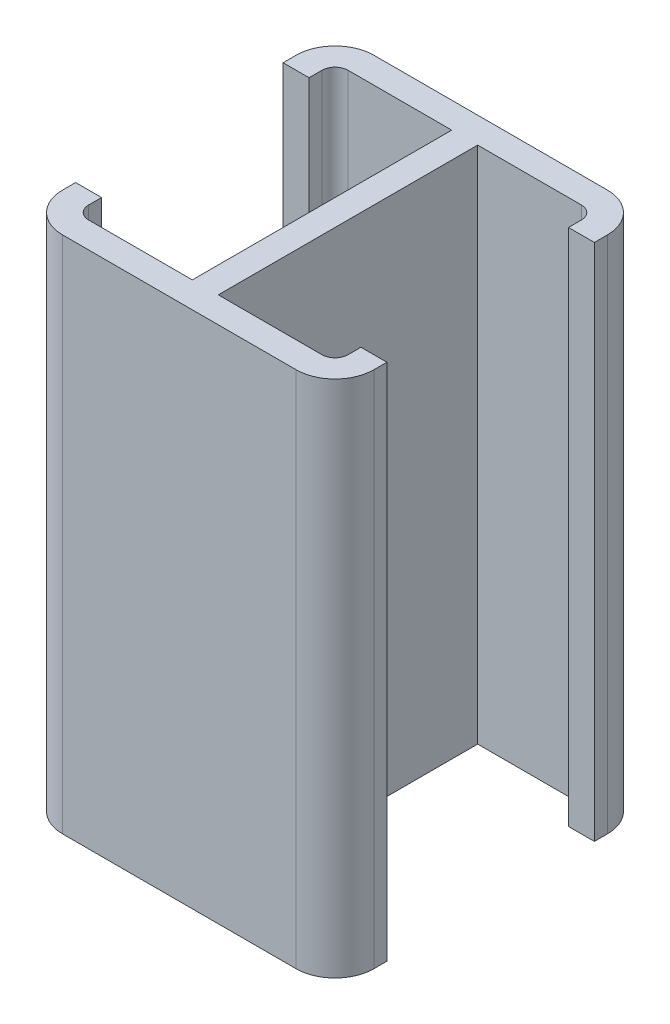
from build123d import *

# Parameters (mm, degrees)
EXTRUDE_1_DEPTH = 200


with BuildPart() as part:
    # Sketch 1 → Extrude 1 (new body)
    with BuildSketch(Plane(origin=(0, 0, 0), x_dir=(1, 0, 0), z_dir=(0, 1, 0))):
        with BuildLine():
            Line((0, 0), (0, -60))
            Line((0, -60), (45, -60))
            ThreePointArc((45, -60), (55.606601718, -55.606601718), (60, -45))
            Line((60, -45), (60, -40))
            Line((60, -40), (50, -40))
            Line((50, -40), (50, -45))
            ThreePointArc((50, -45), (48.535533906, -48.535533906), (45, -50))
            Line((45, -50), (5, -50))
            Line((5, -50), (5, 0))
            Line((5, 0), (0, 0))
        make_face()
    extrude(amount=EXTRUDE_1_DEPTH)

    # Mirror 1: part across plane


with BuildPart() as part_1:
    add(part.part)
    add(part.part.mirror(Plane(origin=(0, 200, 0), x_dir=(0, 0, 1), z_dir=(1, 0, 0))))

    # Mirror 2: part across plane


with BuildPart() as part_2:
    add(part_1.part)
    add(part_1.part.mirror(Plane(origin=(5, 200, 0), x_dir=(1, 0, 0), z_dir=(0, 0, 1))))


solid = part_2.part
